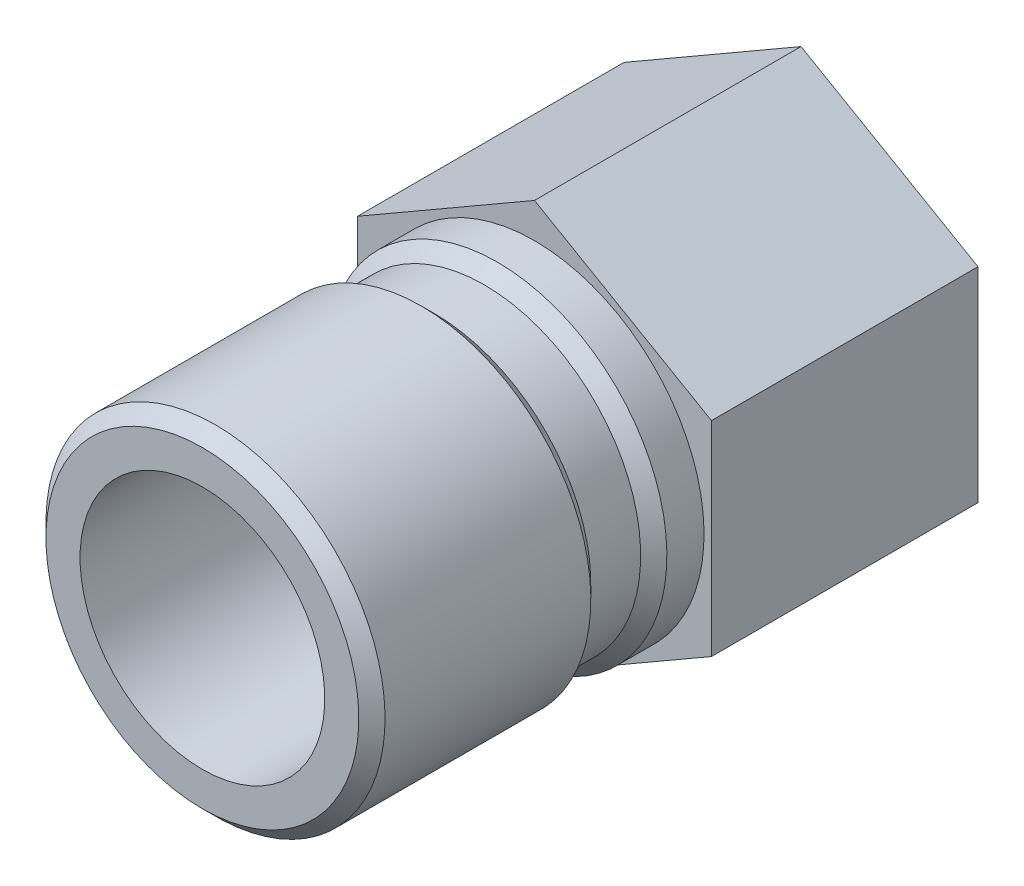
ISO-10303-21;
HEADER;
FILE_DESCRIPTION(('STEP AP214'),'2;1');
FILE_NAME('part.step','',(''),(''),'','','');
FILE_SCHEMA(('AUTOMOTIVE_DESIGN { 1 0 10303 214 1 1 1 1 }'));
ENDSEC;
DATA;
#1=APPLICATION_CONTEXT('core data for automotive mechanical design processes');
#2=APPLICATION_PROTOCOL_DEFINITION('international standard','automotive_design',2000,#1);
#3=PRODUCT_CONTEXT('',#1,'mechanical');
#4=PRODUCT('Part','Part','',(#3));
#5=PRODUCT_RELATED_PRODUCT_CATEGORY('part','',(#4));
#6=PRODUCT_DEFINITION_FORMATION('','',#4);
#7=PRODUCT_DEFINITION_CONTEXT('part definition',#1,'design');
#8=PRODUCT_DEFINITION('design','',#6,#7);
#9=PRODUCT_DEFINITION_SHAPE('','',#8);
#10=(LENGTH_UNIT() NAMED_UNIT(*) SI_UNIT(.MILLI.,.METRE.));
#11=(NAMED_UNIT(*) PLANE_ANGLE_UNIT() SI_UNIT($,.RADIAN.));
#12=(NAMED_UNIT(*) SI_UNIT($,.STERADIAN.) SOLID_ANGLE_UNIT());
#13=UNCERTAINTY_MEASURE_WITH_UNIT(LENGTH_MEASURE(1.E-05),#10,'distance_accuracy_value','');
#14=(GEOMETRIC_REPRESENTATION_CONTEXT(3) GLOBAL_UNCERTAINTY_ASSIGNED_CONTEXT((#13)) GLOBAL_UNIT_ASSIGNED_CONTEXT((#10,
#11,#12)) REPRESENTATION_CONTEXT('',''));
#15=CARTESIAN_POINT('',(0.,0.,0.));
#16=DIRECTION('',(0.,0.,1.));
#17=DIRECTION('',(1.,0.,0.));
#18=AXIS2_PLACEMENT_3D('',#15,#16,#17);
#19=CARTESIAN_POINT('',(0.,9.8552,0.));
#20=DIRECTION('',(0.,0.,1.));
#21=DIRECTION('',(0.,-1.,0.));
#22=AXIS2_PLACEMENT_3D('',#19,#20,#21);
#23=PLANE('',#22);
#24=CARTESIAN_POINT('',(0.,0.,0.));
#25=DIRECTION('',(0.,0.,-1.));
#26=DIRECTION('',(0.,1.,0.));
#27=AXIS2_PLACEMENT_3D('',#24,#25,#26);
#28=CIRCLE('',#27,9.8552);
#29=CARTESIAN_POINT('',(0.,9.8552,0.));
#30=VERTEX_POINT('',#29);
#31=EDGE_CURVE('E147',#30,#30,#28,.T.);
#32=ORIENTED_EDGE('',*,*,#31,.T.);
#33=EDGE_LOOP('',(#32));
#34=FACE_BOUND('',#33,.T.);
#35=DIRECTION('',(-0.866025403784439,0.5,0.));
#36=VECTOR('',#35,1.);
#37=CARTESIAN_POINT('',(10.287,5.93920221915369,0.));
#38=LINE('',#37,#36);
#39=CARTESIAN_POINT('',(10.287,5.93920221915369,0.));
#40=VERTEX_POINT('',#39);
#41=CARTESIAN_POINT('',(0.,11.8784044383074,0.));
#42=VERTEX_POINT('',#41);
#43=EDGE_CURVE('E128',#40,#42,#38,.T.);
#44=ORIENTED_EDGE('',*,*,#43,.T.);
#45=DIRECTION('',(-0.866025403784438,-0.5,0.));
#46=VECTOR('',#45,1.);
#47=CARTESIAN_POINT('',(0.,11.8784044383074,0.));
#48=LINE('',#47,#46);
#49=CARTESIAN_POINT('',(-10.287,5.93920221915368,0.));
#50=VERTEX_POINT('',#49);
#51=EDGE_CURVE('E117',#42,#50,#48,.T.);
#52=ORIENTED_EDGE('',*,*,#51,.T.);
#53=DIRECTION('',(0.,-1.,0.));
#54=VECTOR('',#53,1.);
#55=CARTESIAN_POINT('',(-10.287,5.93920221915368,0.));
#56=LINE('',#55,#54);
#57=CARTESIAN_POINT('',(-10.287,-5.93920221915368,0.));
#58=VERTEX_POINT('',#57);
#59=EDGE_CURVE('E120',#50,#58,#56,.T.);
#60=ORIENTED_EDGE('',*,*,#59,.T.);
#61=DIRECTION('',(0.866025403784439,-0.5,0.));
#62=VECTOR('',#61,1.);
#63=CARTESIAN_POINT('',(-10.287,-5.93920221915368,0.));
#64=LINE('',#63,#62);
#65=CARTESIAN_POINT('',(0.,-11.8784044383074,0.));
#66=VERTEX_POINT('',#65);
#67=EDGE_CURVE('E48',#58,#66,#64,.T.);
#68=ORIENTED_EDGE('',*,*,#67,.T.);
#69=DIRECTION('',(0.866025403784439,0.5,0.));
#70=VECTOR('',#69,1.);
#71=CARTESIAN_POINT('',(0.,-11.8784044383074,0.));
#72=LINE('',#71,#70);
#73=CARTESIAN_POINT('',(10.287,-5.93920221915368,0.));
#74=VERTEX_POINT('',#73);
#75=EDGE_CURVE('E93',#66,#74,#72,.T.);
#76=ORIENTED_EDGE('',*,*,#75,.T.);
#77=DIRECTION('',(0.,1.,0.));
#78=VECTOR('',#77,1.);
#79=CARTESIAN_POINT('',(10.287,-5.93920221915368,0.));
#80=LINE('',#79,#78);
#81=EDGE_CURVE('E125',#74,#40,#80,.T.);
#82=ORIENTED_EDGE('',*,*,#81,.T.);
#83=EDGE_LOOP('',(#44,#52,#60,#68,#76,#82));
#84=FACE_BOUND('',#83,.T.);
#85=ADVANCED_FACE('F33',(#34,#84),#23,.T.);
#86=CARTESIAN_POINT('',(0.,12.3864044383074,-15.494));
#87=DIRECTION('',(0.,0.,-1.));
#88=DIRECTION('',(0.,1.,0.));
#89=AXIS2_PLACEMENT_3D('',#86,#87,#88);
#90=PLANE('',#89);
#91=CARTESIAN_POINT('',(0.,0.,-15.494));
#92=DIRECTION('',(0.,0.,-1.));
#93=DIRECTION('',(0.,1.,0.));
#94=AXIS2_PLACEMENT_3D('',#91,#92,#93);
#95=CIRCLE('',#94,7.82883341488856);
#96=CARTESIAN_POINT('',(0.,7.82883341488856,-15.494));
#97=VERTEX_POINT('',#96);
#98=EDGE_CURVE('E144',#97,#97,#95,.T.);
#99=ORIENTED_EDGE('',*,*,#98,.F.);
#100=EDGE_LOOP('',(#99));
#101=FACE_BOUND('',#100,.T.);
#102=DIRECTION('',(0.,-1.,0.));
#103=VECTOR('',#102,1.);
#104=CARTESIAN_POINT('',(-10.287,5.93920221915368,-15.494));
#105=LINE('',#104,#103);
#106=CARTESIAN_POINT('',(-10.287,5.93920221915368,-15.494));
#107=VERTEX_POINT('',#106);
#108=CARTESIAN_POINT('',(-10.287,-5.93920221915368,-15.494));
#109=VERTEX_POINT('',#108);
#110=EDGE_CURVE('E103',#107,#109,#105,.T.);
#111=ORIENTED_EDGE('',*,*,#110,.F.);
#112=DIRECTION('',(-0.866025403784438,-0.5,0.));
#113=VECTOR('',#112,1.);
#114=CARTESIAN_POINT('',(0.,11.8784044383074,-15.494));
#115=LINE('',#114,#113);
#116=CARTESIAN_POINT('',(0.,11.8784044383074,-15.494));
#117=VERTEX_POINT('',#116);
#118=EDGE_CURVE('E56',#117,#107,#115,.T.);
#119=ORIENTED_EDGE('',*,*,#118,.F.);
#120=DIRECTION('',(-0.866025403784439,0.5,0.));
#121=VECTOR('',#120,1.);
#122=CARTESIAN_POINT('',(10.287,5.93920221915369,-15.494));
#123=LINE('',#122,#121);
#124=CARTESIAN_POINT('',(10.287,5.93920221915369,-15.494));
#125=VERTEX_POINT('',#124);
#126=EDGE_CURVE('E110',#125,#117,#123,.T.);
#127=ORIENTED_EDGE('',*,*,#126,.F.);
#128=DIRECTION('',(0.,1.,0.));
#129=VECTOR('',#128,1.);
#130=CARTESIAN_POINT('',(10.287,-5.93920221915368,-15.494));
#131=LINE('',#130,#129);
#132=CARTESIAN_POINT('',(10.287,-5.93920221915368,-15.494));
#133=VERTEX_POINT('',#132);
#134=EDGE_CURVE('E108',#133,#125,#131,.T.);
#135=ORIENTED_EDGE('',*,*,#134,.F.);
#136=DIRECTION('',(0.866025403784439,0.5,0.));
#137=VECTOR('',#136,1.);
#138=CARTESIAN_POINT('',(0.,-11.8784044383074,-15.494));
#139=LINE('',#138,#137);
#140=CARTESIAN_POINT('',(0.,-11.8784044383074,-15.494));
#141=VERTEX_POINT('',#140);
#142=EDGE_CURVE('E90',#141,#133,#139,.T.);
#143=ORIENTED_EDGE('',*,*,#142,.F.);
#144=DIRECTION('',(0.866025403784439,-0.5,0.));
#145=VECTOR('',#144,1.);
#146=CARTESIAN_POINT('',(-10.287,-5.93920221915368,-15.494));
#147=LINE('',#146,#145);
#148=EDGE_CURVE('E98',#109,#141,#147,.T.);
#149=ORIENTED_EDGE('',*,*,#148,.F.);
#150=EDGE_LOOP('',(#111,#119,#127,#135,#143,#149));
#151=FACE_BOUND('',#150,.T.);
#152=ADVANCED_FACE('F105',(#101,#151),#90,.T.);
#153=CARTESIAN_POINT('',(0.,0.,0.));
#154=DIRECTION('',(0.,0.,-1.));
#155=DIRECTION('',(0.,1.,0.));
#156=AXIS2_PLACEMENT_3D('',#153,#154,#155);
#157=CYLINDRICAL_SURFACE('',#156,7.112);
#158=CARTESIAN_POINT('',(0.,0.,-3.38570156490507));
#159=DIRECTION('',(0.,0.,-1.));
#160=DIRECTION('',(0.,1.,0.));
#161=AXIS2_PLACEMENT_3D('',#158,#159,#160);
#162=CIRCLE('',#161,7.112);
#163=CARTESIAN_POINT('',(0.,7.112,-3.38570156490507));
#164=VERTEX_POINT('',#163);
#165=EDGE_CURVE('E133',#164,#164,#162,.T.);
#166=ORIENTED_EDGE('',*,*,#165,.T.);
#167=EDGE_LOOP('',(#166));
#168=FACE_BOUND('',#167,.T.);
#169=CARTESIAN_POINT('',(0.,0.,19.304));
#170=DIRECTION('',(0.,0.,-1.));
#171=DIRECTION('',(0.,1.,0.));
#172=AXIS2_PLACEMENT_3D('',#169,#170,#171);
#173=CIRCLE('',#172,7.112);
#174=CARTESIAN_POINT('',(0.,7.112,19.304));
#175=VERTEX_POINT('',#174);
#176=EDGE_CURVE('E12',#175,#175,#173,.T.);
#177=ORIENTED_EDGE('',*,*,#176,.F.);
#178=EDGE_LOOP('',(#177));
#179=FACE_BOUND('',#178,.T.);
#180=ADVANCED_FACE('F35',(#168,#179),#157,.F.);
#181=CARTESIAN_POINT('',(0.,7.112,19.304));
#182=DIRECTION('',(0.,0.,1.));
#183=DIRECTION('',(0.,-1.,0.));
#184=AXIS2_PLACEMENT_3D('',#181,#182,#183);
#185=PLANE('',#184);
#186=ORIENTED_EDGE('',*,*,#176,.T.);
#187=EDGE_LOOP('',(#186));
#188=FACE_BOUND('',#187,.T.);
#189=CARTESIAN_POINT('',(0.,0.,19.304));
#190=DIRECTION('',(0.,0.,-1.));
#191=DIRECTION('',(0.,1.,0.));
#192=AXIS2_PLACEMENT_3D('',#189,#190,#191);
#193=CIRCLE('',#192,9.0932);
#194=CARTESIAN_POINT('',(0.,9.0932,19.304));
#195=VERTEX_POINT('',#194);
#196=EDGE_CURVE('E41',#195,#195,#193,.T.);
#197=ORIENTED_EDGE('',*,*,#196,.F.);
#198=EDGE_LOOP('',(#197));
#199=FACE_BOUND('',#198,.T.);
#200=ADVANCED_FACE('F170',(#188,#199),#185,.T.);
#201=CARTESIAN_POINT('',(0.,0.,18.542));
#202=DIRECTION('',(0.,0.,-1.));
#203=DIRECTION('',(0.,1.,0.));
#204=AXIS2_PLACEMENT_3D('',#201,#202,#203);
#205=CONICAL_SURFACE('',#204,9.8552,0.785398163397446);
#206=ORIENTED_EDGE('',*,*,#196,.T.);
#207=EDGE_LOOP('',(#206));
#208=FACE_BOUND('',#207,.T.);
#209=CARTESIAN_POINT('',(0.,0.,18.542));
#210=DIRECTION('',(0.,0.,-1.));
#211=DIRECTION('',(0.,1.,0.));
#212=AXIS2_PLACEMENT_3D('',#209,#210,#211);
#213=CIRCLE('',#212,9.8552);
#214=CARTESIAN_POINT('',(0.,9.8552,18.542));
#215=VERTEX_POINT('',#214);
#216=EDGE_CURVE('E162',#215,#215,#213,.T.);
#217=ORIENTED_EDGE('',*,*,#216,.F.);
#218=EDGE_LOOP('',(#217));
#219=FACE_BOUND('',#218,.T.);
#220=ADVANCED_FACE('F167',(#208,#219),#205,.T.);
#221=CARTESIAN_POINT('',(0.,0.,0.));
#222=DIRECTION('',(0.,0.,-1.));
#223=DIRECTION('',(0.,1.,0.));
#224=AXIS2_PLACEMENT_3D('',#221,#222,#223);
#225=CYLINDRICAL_SURFACE('',#224,9.8552);
#226=ORIENTED_EDGE('',*,*,#216,.T.);
#227=EDGE_LOOP('',(#226));
#228=FACE_BOUND('',#227,.T.);
#229=CARTESIAN_POINT('',(0.,0.,6.5786));
#230=DIRECTION('',(0.,0.,-1.));
#231=DIRECTION('',(0.,1.,0.));
#232=AXIS2_PLACEMENT_3D('',#229,#230,#231);
#233=CIRCLE('',#232,9.8552);
#234=CARTESIAN_POINT('',(0.,9.8552,6.5786));
#235=VERTEX_POINT('',#234);
#236=EDGE_CURVE('E159',#235,#235,#233,.T.);
#237=ORIENTED_EDGE('',*,*,#236,.F.);
#238=EDGE_LOOP('',(#237));
#239=FACE_BOUND('',#238,.T.);
#240=ADVANCED_FACE('F177',(#228,#239),#225,.T.);
#241=CARTESIAN_POINT('',(0.,0.,5.8166));
#242=DIRECTION('',(0.,0.,1.));
#243=DIRECTION('',(0.,-1.,0.));
#244=AXIS2_PLACEMENT_3D('',#241,#242,#243);
#245=CONICAL_SURFACE('',#244,9.0932,0.785398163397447);
#246=ORIENTED_EDGE('',*,*,#236,.T.);
#247=EDGE_LOOP('',(#246));
#248=FACE_BOUND('',#247,.T.);
#249=CARTESIAN_POINT('',(0.,0.,5.8166));
#250=DIRECTION('',(0.,0.,-1.));
#251=DIRECTION('',(0.,1.,0.));
#252=AXIS2_PLACEMENT_3D('',#249,#250,#251);
#253=CIRCLE('',#252,9.0932);
#254=CARTESIAN_POINT('',(0.,9.0932,5.8166));
#255=VERTEX_POINT('',#254);
#256=EDGE_CURVE('E156',#255,#255,#253,.T.);
#257=ORIENTED_EDGE('',*,*,#256,.F.);
#258=EDGE_LOOP('',(#257));
#259=FACE_BOUND('',#258,.T.);
#260=ADVANCED_FACE('F203',(#248,#259),#245,.T.);
#261=CARTESIAN_POINT('',(0.,0.,0.));
#262=DIRECTION('',(0.,0.,-1.));
#263=DIRECTION('',(0.,1.,0.));
#264=AXIS2_PLACEMENT_3D('',#261,#262,#263);
#265=CYLINDRICAL_SURFACE('',#264,9.0932);
#266=ORIENTED_EDGE('',*,*,#256,.T.);
#267=EDGE_LOOP('',(#266));
#268=FACE_BOUND('',#267,.T.);
#269=CARTESIAN_POINT('',(0.,0.,2.921));
#270=DIRECTION('',(0.,0.,-1.));
#271=DIRECTION('',(0.,1.,0.));
#272=AXIS2_PLACEMENT_3D('',#269,#270,#271);
#273=CIRCLE('',#272,9.0932);
#274=CARTESIAN_POINT('',(0.,9.0932,2.921));
#275=VERTEX_POINT('',#274);
#276=EDGE_CURVE('E153',#275,#275,#273,.T.);
#277=ORIENTED_EDGE('',*,*,#276,.F.);
#278=EDGE_LOOP('',(#277));
#279=FACE_BOUND('',#278,.T.);
#280=ADVANCED_FACE('F199',(#268,#279),#265,.T.);
#281=CARTESIAN_POINT('',(0.,0.,2.159));
#282=DIRECTION('',(0.,0.,-1.));
#283=DIRECTION('',(0.,1.,0.));
#284=AXIS2_PLACEMENT_3D('',#281,#282,#283);
#285=CONICAL_SURFACE('',#284,9.8552,0.785398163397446);
#286=ORIENTED_EDGE('',*,*,#276,.T.);
#287=EDGE_LOOP('',(#286));
#288=FACE_BOUND('',#287,.T.);
#289=CARTESIAN_POINT('',(0.,0.,2.159));
#290=DIRECTION('',(0.,0.,-1.));
#291=DIRECTION('',(0.,1.,0.));
#292=AXIS2_PLACEMENT_3D('',#289,#290,#291);
#293=CIRCLE('',#292,9.8552);
#294=CARTESIAN_POINT('',(0.,9.8552,2.159));
#295=VERTEX_POINT('',#294);
#296=EDGE_CURVE('E150',#295,#295,#293,.T.);
#297=ORIENTED_EDGE('',*,*,#296,.F.);
#298=EDGE_LOOP('',(#297));
#299=FACE_BOUND('',#298,.T.);
#300=ADVANCED_FACE('F195',(#288,#299),#285,.T.);
#301=CARTESIAN_POINT('',(0.,0.,0.));
#302=DIRECTION('',(0.,0.,-1.));
#303=DIRECTION('',(0.,1.,0.));
#304=AXIS2_PLACEMENT_3D('',#301,#302,#303);
#305=CYLINDRICAL_SURFACE('',#304,9.8552);
#306=ORIENTED_EDGE('',*,*,#296,.T.);
#307=EDGE_LOOP('',(#306));
#308=FACE_BOUND('',#307,.T.);
#309=ORIENTED_EDGE('',*,*,#31,.F.);
#310=EDGE_LOOP('',(#309));
#311=FACE_BOUND('',#310,.T.);
#312=ADVANCED_FACE('F191',(#308,#311),#305,.T.);
#313=CARTESIAN_POINT('',(0.,0.,-3.56870000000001));
#314=DIRECTION('',(0.,0.,-1.));
#315=DIRECTION('',(0.,1.,0.));
#316=AXIS2_PLACEMENT_3D('',#313,#314,#315);
#317=CONICAL_SURFACE('',#316,7.45617,0.0312396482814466);
#318=ORIENTED_EDGE('',*,*,#98,.T.);
#319=EDGE_LOOP('',(#318));
#320=FACE_BOUND('',#319,.T.);
#321=CARTESIAN_POINT('',(0.,0.,-3.56870000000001));
#322=DIRECTION('',(0.,0.,-1.));
#323=DIRECTION('',(0.,1.,0.));
#324=AXIS2_PLACEMENT_3D('',#321,#322,#323);
#325=CIRCLE('',#324,7.45617);
#326=CARTESIAN_POINT('',(0.,7.45617,-3.56870000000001));
#327=VERTEX_POINT('',#326);
#328=EDGE_CURVE('E141',#327,#327,#325,.T.);
#329=ORIENTED_EDGE('',*,*,#328,.F.);
#330=EDGE_LOOP('',(#329));
#331=FACE_BOUND('',#330,.T.);
#332=ADVANCED_FACE('F194',(#320,#331),#317,.F.);
#333=CARTESIAN_POINT('',(0.,0.,-3.38570156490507));
#334=DIRECTION('',(0.,0.,-1.));
#335=DIRECTION('',(0.,1.,0.));
#336=AXIS2_PLACEMENT_3D('',#333,#334,#335);
#337=CONICAL_SURFACE('',#336,7.112,1.08210413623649);
#338=ORIENTED_EDGE('',*,*,#328,.T.);
#339=EDGE_LOOP('',(#338));
#340=FACE_BOUND('',#339,.T.);
#341=ORIENTED_EDGE('',*,*,#165,.F.);
#342=EDGE_LOOP('',(#341));
#343=FACE_BOUND('',#342,.T.);
#344=ADVANCED_FACE('F247',(#340,#343),#337,.F.);
#345=CARTESIAN_POINT('',(0.,11.8784044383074,-15.494));
#346=DIRECTION('',(-0.5,0.866025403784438,0.));
#347=DIRECTION('',(-0.866025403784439,-0.5,0.));
#348=AXIS2_PLACEMENT_3D('',#345,#346,#347);
#349=PLANE('',#348);
#350=ORIENTED_EDGE('',*,*,#51,.F.);
#351=DIRECTION('',(0.,0.,1.));
#352=VECTOR('',#351,1.);
#353=CARTESIAN_POINT('',(0.,11.8784044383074,-15.494));
#354=LINE('',#353,#352);
#355=EDGE_CURVE('E131',#117,#42,#354,.T.);
#356=ORIENTED_EDGE('',*,*,#355,.F.);
#357=ORIENTED_EDGE('',*,*,#118,.T.);
#358=DIRECTION('',(0.,0.,1.));
#359=VECTOR('',#358,1.);
#360=CARTESIAN_POINT('',(-10.287,5.93920221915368,-15.494));
#361=LINE('',#360,#359);
#362=EDGE_CURVE('E116',#107,#50,#361,.T.);
#363=ORIENTED_EDGE('',*,*,#362,.T.);
#364=EDGE_LOOP('',(#350,#356,#357,#363));
#365=FACE_BOUND('',#364,.T.);
#366=ADVANCED_FACE('F254',(#365),#349,.T.);
#367=CARTESIAN_POINT('',(10.287,5.93920221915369,-15.494));
#368=DIRECTION('',(0.5,0.866025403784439,0.));
#369=DIRECTION('',(-0.866025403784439,0.5,0.));
#370=AXIS2_PLACEMENT_3D('',#367,#368,#369);
#371=PLANE('',#370);
#372=ORIENTED_EDGE('',*,*,#43,.F.);
#373=DIRECTION('',(0.,0.,1.));
#374=VECTOR('',#373,1.);
#375=CARTESIAN_POINT('',(10.287,5.93920221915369,-15.494));
#376=LINE('',#375,#374);
#377=EDGE_CURVE('E134',#125,#40,#376,.T.);
#378=ORIENTED_EDGE('',*,*,#377,.F.);
#379=ORIENTED_EDGE('',*,*,#126,.T.);
#380=ORIENTED_EDGE('',*,*,#355,.T.);
#381=EDGE_LOOP('',(#372,#378,#379,#380));
#382=FACE_BOUND('',#381,.T.);
#383=ADVANCED_FACE('F262',(#382),#371,.T.);
#384=CARTESIAN_POINT('',(10.287,-5.93920221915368,-15.494));
#385=DIRECTION('',(1.,0.,0.));
#386=DIRECTION('',(0.,0.,-1.));
#387=AXIS2_PLACEMENT_3D('',#384,#385,#386);
#388=PLANE('',#387);
#389=ORIENTED_EDGE('',*,*,#81,.F.);
#390=DIRECTION('',(0.,0.,1.));
#391=VECTOR('',#390,1.);
#392=CARTESIAN_POINT('',(10.287,-5.93920221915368,-15.494));
#393=LINE('',#392,#391);
#394=EDGE_CURVE('E94',#133,#74,#393,.T.);
#395=ORIENTED_EDGE('',*,*,#394,.F.);
#396=ORIENTED_EDGE('',*,*,#134,.T.);
#397=ORIENTED_EDGE('',*,*,#377,.T.);
#398=EDGE_LOOP('',(#389,#395,#396,#397));
#399=FACE_BOUND('',#398,.T.);
#400=ADVANCED_FACE('F270',(#399),#388,.T.);
#401=CARTESIAN_POINT('',(0.,-11.8784044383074,-15.494));
#402=DIRECTION('',(0.5,-0.866025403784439,0.));
#403=DIRECTION('',(0.866025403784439,0.5,0.));
#404=AXIS2_PLACEMENT_3D('',#401,#402,#403);
#405=PLANE('',#404);
#406=ORIENTED_EDGE('',*,*,#75,.F.);
#407=DIRECTION('',(0.,0.,1.));
#408=VECTOR('',#407,1.);
#409=CARTESIAN_POINT('',(0.,-11.8784044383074,-15.494));
#410=LINE('',#409,#408);
#411=EDGE_CURVE('E86',#141,#66,#410,.T.);
#412=ORIENTED_EDGE('',*,*,#411,.F.);
#413=ORIENTED_EDGE('',*,*,#142,.T.);
#414=ORIENTED_EDGE('',*,*,#394,.T.);
#415=EDGE_LOOP('',(#406,#412,#413,#414));
#416=FACE_BOUND('',#415,.T.);
#417=ADVANCED_FACE('F88',(#416),#405,.T.);
#418=CARTESIAN_POINT('',(-10.287,-5.93920221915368,-15.494));
#419=DIRECTION('',(-0.5,-0.866025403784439,0.));
#420=DIRECTION('',(0.866025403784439,-0.5,0.));
#421=AXIS2_PLACEMENT_3D('',#418,#419,#420);
#422=PLANE('',#421);
#423=ORIENTED_EDGE('',*,*,#67,.F.);
#424=DIRECTION('',(0.,0.,1.));
#425=VECTOR('',#424,1.);
#426=CARTESIAN_POINT('',(-10.287,-5.93920221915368,-15.494));
#427=LINE('',#426,#425);
#428=EDGE_CURVE('E95',#109,#58,#427,.T.);
#429=ORIENTED_EDGE('',*,*,#428,.F.);
#430=ORIENTED_EDGE('',*,*,#148,.T.);
#431=ORIENTED_EDGE('',*,*,#411,.T.);
#432=EDGE_LOOP('',(#423,#429,#430,#431));
#433=FACE_BOUND('',#432,.T.);
#434=ADVANCED_FACE('F99',(#433),#422,.T.);
#435=CARTESIAN_POINT('',(-10.287,5.93920221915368,-15.494));
#436=DIRECTION('',(-1.,0.,0.));
#437=DIRECTION('',(0.,0.,1.));
#438=AXIS2_PLACEMENT_3D('',#435,#436,#437);
#439=PLANE('',#438);
#440=ORIENTED_EDGE('',*,*,#59,.F.);
#441=ORIENTED_EDGE('',*,*,#362,.F.);
#442=ORIENTED_EDGE('',*,*,#110,.T.);
#443=ORIENTED_EDGE('',*,*,#428,.T.);
#444=EDGE_LOOP('',(#440,#441,#442,#443));
#445=FACE_BOUND('',#444,.T.);
#446=ADVANCED_FACE('F291',(#445),#439,.T.);
#447=CLOSED_SHELL('',(#85,#152,#180,#200,#220,#240,#260,#280,#300,#312,#332,#344,#366,#383,#400,
#417,#434,#446));
#448=MANIFOLD_SOLID_BREP('B2',#447);
#449=ADVANCED_BREP_SHAPE_REPRESENTATION('',(#18,#448),#14);
#450=SHAPE_DEFINITION_REPRESENTATION(#9,#449);
ENDSEC;
END-ISO-10303-21;
